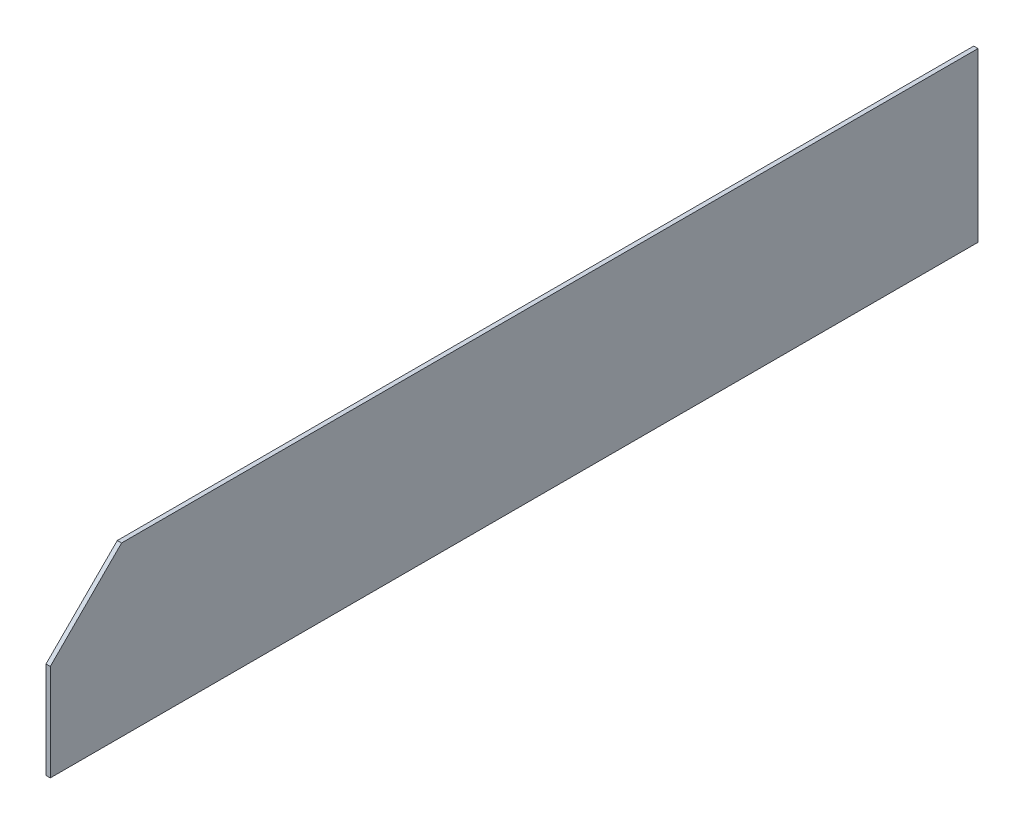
ISO-10303-21;
HEADER;
FILE_DESCRIPTION(('STEP AP214'),'2;1');
FILE_NAME('part.step','',(''),(''),'','','');
FILE_SCHEMA(('AUTOMOTIVE_DESIGN { 1 0 10303 214 1 1 1 1 }'));
ENDSEC;
DATA;
#1=APPLICATION_CONTEXT('core data for automotive mechanical design processes');
#2=APPLICATION_PROTOCOL_DEFINITION('international standard','automotive_design',2000,#1);
#3=PRODUCT_CONTEXT('',#1,'mechanical');
#4=PRODUCT('Part','Part','',(#3));
#5=PRODUCT_RELATED_PRODUCT_CATEGORY('part','',(#4));
#6=PRODUCT_DEFINITION_FORMATION('','',#4);
#7=PRODUCT_DEFINITION_CONTEXT('part definition',#1,'design');
#8=PRODUCT_DEFINITION('design','',#6,#7);
#9=PRODUCT_DEFINITION_SHAPE('','',#8);
#10=(LENGTH_UNIT() NAMED_UNIT(*) SI_UNIT(.MILLI.,.METRE.));
#11=(NAMED_UNIT(*) PLANE_ANGLE_UNIT() SI_UNIT($,.RADIAN.));
#12=(NAMED_UNIT(*) SI_UNIT($,.STERADIAN.) SOLID_ANGLE_UNIT());
#13=UNCERTAINTY_MEASURE_WITH_UNIT(LENGTH_MEASURE(1.E-05),#10,'distance_accuracy_value','');
#14=(GEOMETRIC_REPRESENTATION_CONTEXT(3) GLOBAL_UNCERTAINTY_ASSIGNED_CONTEXT((#13)) GLOBAL_UNIT_ASSIGNED_CONTEXT((#10,
#11,#12)) REPRESENTATION_CONTEXT('',''));
#15=CARTESIAN_POINT('',(0.,0.,0.));
#16=DIRECTION('',(0.,0.,1.));
#17=DIRECTION('',(1.,0.,0.));
#18=AXIS2_PLACEMENT_3D('',#15,#16,#17);
#19=CARTESIAN_POINT('',(-610.715370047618,277.550649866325,702.615752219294));
#20=DIRECTION('',(0.,-1.,0.));
#21=DIRECTION('',(0.,0.,-1.));
#22=AXIS2_PLACEMENT_3D('',#19,#20,#21);
#23=PLANE('',#22);
#24=DIRECTION('',(0.,0.,-1.));
#25=VECTOR('',#24,1.);
#26=CARTESIAN_POINT('',(-607.540370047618,277.550649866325,702.615752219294));
#27=LINE('',#26,#25);
#28=CARTESIAN_POINT('',(-607.540370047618,277.550649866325,1391.59075221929));
#29=VERTEX_POINT('',#28);
#30=CARTESIAN_POINT('',(-607.540370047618,277.550649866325,702.615752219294));
#31=VERTEX_POINT('',#30);
#32=EDGE_CURVE('E117',#29,#31,#27,.T.);
#33=ORIENTED_EDGE('',*,*,#32,.F.);
#34=DIRECTION('',(1.,0.,0.));
#35=VECTOR('',#34,1.);
#36=CARTESIAN_POINT('',(-610.715370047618,277.550649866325,1391.59075221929));
#37=LINE('',#36,#35);
#38=CARTESIAN_POINT('',(-610.715370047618,277.550649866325,1391.59075221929));
#39=VERTEX_POINT('',#38);
#40=EDGE_CURVE('E11',#39,#29,#37,.T.);
#41=ORIENTED_EDGE('',*,*,#40,.F.);
#42=DIRECTION('',(0.,0.,-1.));
#43=VECTOR('',#42,1.);
#44=CARTESIAN_POINT('',(-610.715370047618,277.550649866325,702.615752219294));
#45=LINE('',#44,#43);
#46=CARTESIAN_POINT('',(-610.715370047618,277.550649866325,702.615752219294));
#47=VERTEX_POINT('',#46);
#48=EDGE_CURVE('E112',#39,#47,#45,.T.);
#49=ORIENTED_EDGE('',*,*,#48,.T.);
#50=DIRECTION('',(1.,0.,0.));
#51=VECTOR('',#50,1.);
#52=CARTESIAN_POINT('',(-610.715370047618,277.550649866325,702.615752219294));
#53=LINE('',#52,#51);
#54=EDGE_CURVE('E45',#47,#31,#53,.T.);
#55=ORIENTED_EDGE('',*,*,#54,.T.);
#56=EDGE_LOOP('',(#33,#41,#49,#55));
#57=FACE_BOUND('',#56,.T.);
#58=ADVANCED_FACE('F39',(#57),#23,.T.);
#59=CARTESIAN_POINT('',(-610.715370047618,277.550649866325,1391.59075221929));
#60=DIRECTION('',(0.,0.,1.));
#61=DIRECTION('',(0.,-1.,0.));
#62=AXIS2_PLACEMENT_3D('',#59,#60,#61);
#63=PLANE('',#62);
#64=DIRECTION('',(0.,-1.,0.));
#65=VECTOR('',#64,1.);
#66=CARTESIAN_POINT('',(-607.540370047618,277.550649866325,1391.59075221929));
#67=LINE('',#66,#65);
#68=CARTESIAN_POINT('',(-607.540370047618,349.260521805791,1391.59075221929));
#69=VERTEX_POINT('',#68);
#70=EDGE_CURVE('E124',#69,#29,#67,.T.);
#71=ORIENTED_EDGE('',*,*,#70,.F.);
#72=DIRECTION('',(1.,0.,0.));
#73=VECTOR('',#72,1.);
#74=CARTESIAN_POINT('',(-610.715370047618,349.260521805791,1391.59075221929));
#75=LINE('',#74,#73);
#76=CARTESIAN_POINT('',(-610.715370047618,349.260521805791,1391.59075221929));
#77=VERTEX_POINT('',#76);
#78=EDGE_CURVE('E48',#77,#69,#75,.T.);
#79=ORIENTED_EDGE('',*,*,#78,.F.);
#80=DIRECTION('',(0.,-1.,0.));
#81=VECTOR('',#80,1.);
#82=CARTESIAN_POINT('',(-610.715370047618,277.550649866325,1391.59075221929));
#83=LINE('',#82,#81);
#84=EDGE_CURVE('E107',#77,#39,#83,.T.);
#85=ORIENTED_EDGE('',*,*,#84,.T.);
#86=ORIENTED_EDGE('',*,*,#40,.T.);
#87=EDGE_LOOP('',(#71,#79,#85,#86));
#88=FACE_BOUND('',#87,.T.);
#89=ADVANCED_FACE('F131',(#88),#63,.T.);
#90=CARTESIAN_POINT('',(-610.715370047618,349.260521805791,1391.59075221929));
#91=DIRECTION('',(0.,0.707106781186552,0.707106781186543));
#92=DIRECTION('',(0.,-0.707106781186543,0.707106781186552));
#93=AXIS2_PLACEMENT_3D('',#90,#91,#92);
#94=PLANE('',#93);
#95=DIRECTION('',(0.,-0.707106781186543,0.707106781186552));
#96=VECTOR('',#95,1.);
#97=CARTESIAN_POINT('',(-607.540370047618,349.260521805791,1391.59075221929));
#98=LINE('',#97,#96);
#99=CARTESIAN_POINT('',(-607.540370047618,402.212122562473,1338.63915146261));
#100=VERTEX_POINT('',#99);
#101=EDGE_CURVE('E94',#100,#69,#98,.T.);
#102=ORIENTED_EDGE('',*,*,#101,.F.);
#103=DIRECTION('',(1.,0.,0.));
#104=VECTOR('',#103,1.);
#105=CARTESIAN_POINT('',(-610.715370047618,402.212122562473,1338.63915146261));
#106=LINE('',#105,#104);
#107=CARTESIAN_POINT('',(-610.715370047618,402.212122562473,1338.63915146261));
#108=VERTEX_POINT('',#107);
#109=EDGE_CURVE('E89',#108,#100,#106,.T.);
#110=ORIENTED_EDGE('',*,*,#109,.F.);
#111=DIRECTION('',(0.,-0.707106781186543,0.707106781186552));
#112=VECTOR('',#111,1.);
#113=CARTESIAN_POINT('',(-610.715370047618,349.260521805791,1391.59075221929));
#114=LINE('',#113,#112);
#115=EDGE_CURVE('E93',#108,#77,#114,.T.);
#116=ORIENTED_EDGE('',*,*,#115,.T.);
#117=ORIENTED_EDGE('',*,*,#78,.T.);
#118=EDGE_LOOP('',(#102,#110,#116,#117));
#119=FACE_BOUND('',#118,.T.);
#120=ADVANCED_FACE('F95',(#119),#94,.T.);
#121=CARTESIAN_POINT('',(-610.715370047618,402.212122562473,1338.63915146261));
#122=DIRECTION('',(0.,1.,0.));
#123=DIRECTION('',(0.,0.,1.));
#124=AXIS2_PLACEMENT_3D('',#121,#122,#123);
#125=PLANE('',#124);
#126=DIRECTION('',(0.,0.,1.));
#127=VECTOR('',#126,1.);
#128=CARTESIAN_POINT('',(-607.540370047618,402.212122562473,1338.63915146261));
#129=LINE('',#128,#127);
#130=CARTESIAN_POINT('',(-607.540370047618,402.212122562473,702.615752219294));
#131=VERTEX_POINT('',#130);
#132=EDGE_CURVE('E122',#131,#100,#129,.T.);
#133=ORIENTED_EDGE('',*,*,#132,.F.);
#134=DIRECTION('',(1.,0.,0.));
#135=VECTOR('',#134,1.);
#136=CARTESIAN_POINT('',(-610.715370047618,402.212122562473,702.615752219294));
#137=LINE('',#136,#135);
#138=CARTESIAN_POINT('',(-610.715370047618,402.212122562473,702.615752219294));
#139=VERTEX_POINT('',#138);
#140=EDGE_CURVE('E99',#139,#131,#137,.T.);
#141=ORIENTED_EDGE('',*,*,#140,.F.);
#142=DIRECTION('',(0.,0.,1.));
#143=VECTOR('',#142,1.);
#144=CARTESIAN_POINT('',(-610.715370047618,402.212122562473,1338.63915146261));
#145=LINE('',#144,#143);
#146=EDGE_CURVE('E103',#139,#108,#145,.T.);
#147=ORIENTED_EDGE('',*,*,#146,.T.);
#148=ORIENTED_EDGE('',*,*,#109,.T.);
#149=EDGE_LOOP('',(#133,#141,#147,#148));
#150=FACE_BOUND('',#149,.T.);
#151=ADVANCED_FACE('F108',(#150),#125,.T.);
#152=CARTESIAN_POINT('',(-610.715370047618,402.212122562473,702.615752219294));
#153=DIRECTION('',(0.,0.,-1.));
#154=DIRECTION('',(-1.,0.,0.));
#155=AXIS2_PLACEMENT_3D('',#152,#153,#154);
#156=PLANE('',#155);
#157=DIRECTION('',(0.,1.,0.));
#158=VECTOR('',#157,1.);
#159=CARTESIAN_POINT('',(-607.540370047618,402.212122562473,702.615752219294));
#160=LINE('',#159,#158);
#161=EDGE_CURVE('E119',#31,#131,#160,.T.);
#162=ORIENTED_EDGE('',*,*,#161,.F.);
#163=ORIENTED_EDGE('',*,*,#54,.F.);
#164=DIRECTION('',(0.,1.,0.));
#165=VECTOR('',#164,1.);
#166=CARTESIAN_POINT('',(-610.715370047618,402.212122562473,702.615752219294));
#167=LINE('',#166,#165);
#168=EDGE_CURVE('E109',#47,#139,#167,.T.);
#169=ORIENTED_EDGE('',*,*,#168,.T.);
#170=ORIENTED_EDGE('',*,*,#140,.T.);
#171=EDGE_LOOP('',(#162,#163,#169,#170));
#172=FACE_BOUND('',#171,.T.);
#173=ADVANCED_FACE('F126',(#172),#156,.T.);
#174=CARTESIAN_POINT('',(-610.715370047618,0.,0.));
#175=DIRECTION('',(-1.,0.,0.));
#176=DIRECTION('',(0.,0.,1.));
#177=AXIS2_PLACEMENT_3D('',#174,#175,#176);
#178=PLANE('',#177);
#179=ORIENTED_EDGE('',*,*,#48,.F.);
#180=ORIENTED_EDGE('',*,*,#84,.F.);
#181=ORIENTED_EDGE('',*,*,#115,.F.);
#182=ORIENTED_EDGE('',*,*,#146,.F.);
#183=ORIENTED_EDGE('',*,*,#168,.F.);
#184=EDGE_LOOP('',(#179,#180,#181,#182,#183));
#185=FACE_BOUND('',#184,.T.);
#186=ADVANCED_FACE('F101',(#185),#178,.T.);
#187=CARTESIAN_POINT('',(-607.540370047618,0.,0.));
#188=DIRECTION('',(-1.,0.,0.));
#189=DIRECTION('',(0.,0.,1.));
#190=AXIS2_PLACEMENT_3D('',#187,#188,#189);
#191=PLANE('',#190);
#192=ORIENTED_EDGE('',*,*,#32,.T.);
#193=ORIENTED_EDGE('',*,*,#161,.T.);
#194=ORIENTED_EDGE('',*,*,#132,.T.);
#195=ORIENTED_EDGE('',*,*,#101,.T.);
#196=ORIENTED_EDGE('',*,*,#70,.T.);
#197=EDGE_LOOP('',(#192,#193,#194,#195,#196));
#198=FACE_BOUND('',#197,.T.);
#199=ADVANCED_FACE('F127',(#198),#191,.F.);
#200=CLOSED_SHELL('',(#58,#89,#120,#151,#173,#186,#199));
#201=MANIFOLD_SOLID_BREP('B2',#200);
#202=ADVANCED_BREP_SHAPE_REPRESENTATION('',(#18,#201),#14);
#203=SHAPE_DEFINITION_REPRESENTATION(#9,#202);
ENDSEC;
END-ISO-10303-21;
